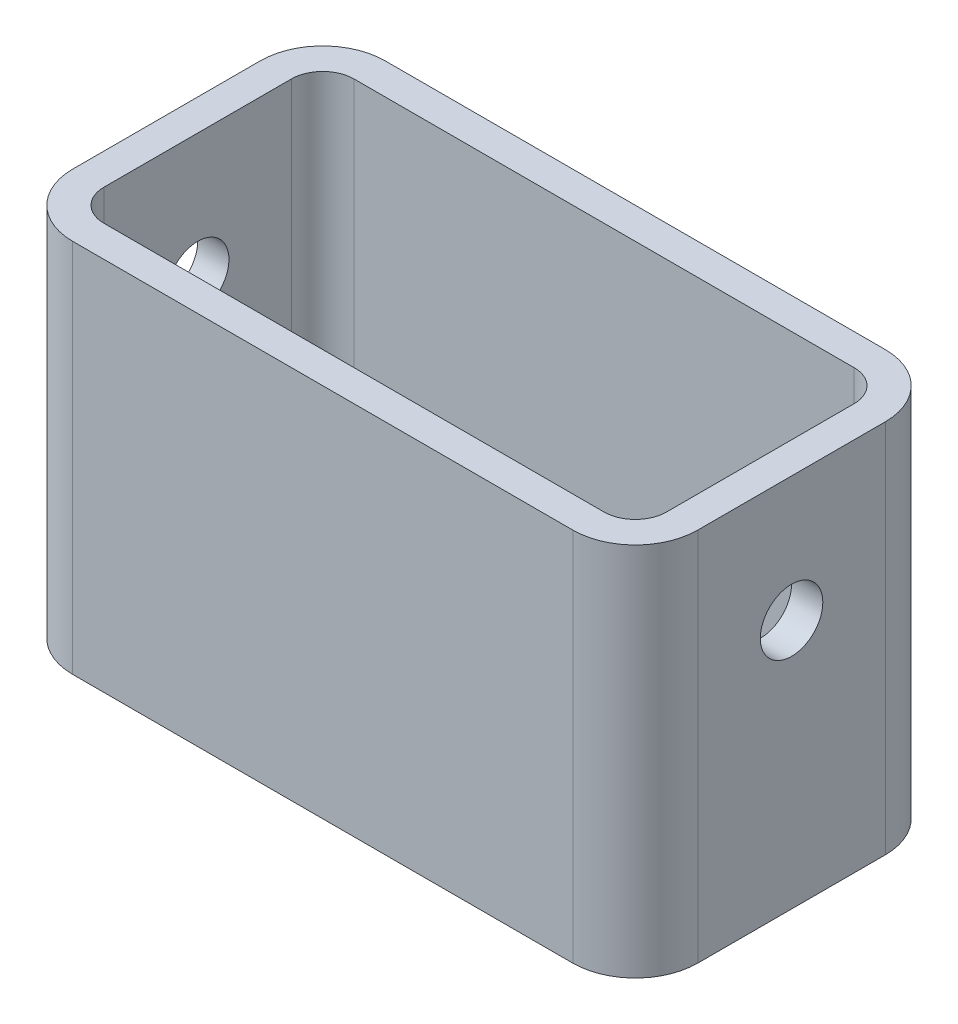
from build123d import *

# Parameters (mm, degrees)
SKETCH1_W          = 100
SKETCH1_H          = 60
BASE_EXTRUDE_DEPTH = 50
FILLET1_R          = 10
SHELL1_T           = -5
SKETCH3_R          = 5
CUT_EXTRUDE1_DEPTH = 127.885775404


with BuildPart() as part:
    # Sketch1 → Base-Extrude (new body)
    with BuildSketch(Plane.XY):
        with Locations((50, 30)):
            Rectangle(SKETCH1_W, SKETCH1_H)
    extrude(amount=BASE_EXTRUDE_DEPTH)

    # Fillet1
    fillet1_edges = [part.edges().sort_by_distance(p)[0] for p in [
        (100, 30, 50),
        (0, 30, 50),
        (100, 30, 0),
        (0, 30, 0),
    ]]
    fillet(fillet1_edges, radius=FILLET1_R)

    # Shell1
    shell1_openings = [part.faces().sort_by_distance(p)[0] for p in [
        (50, 60, 25),
    ]]
    offset(amount=SHELL1_T, openings=shell1_openings, kind=Kind.INTERSECTION)

    # Sketch3 → Cut-Extrude1 (cut, through all)
    with BuildSketch(Plane(origin=(100, 0, 0), x_dir=(0, 0, -1), z_dir=(1, 0, 0))):
        with Locations((-25, 40)):
            Circle(SKETCH3_R)
    extrude(amount=-CUT_EXTRUDE1_DEPTH, mode=Mode.SUBTRACT)


solid = part.part
